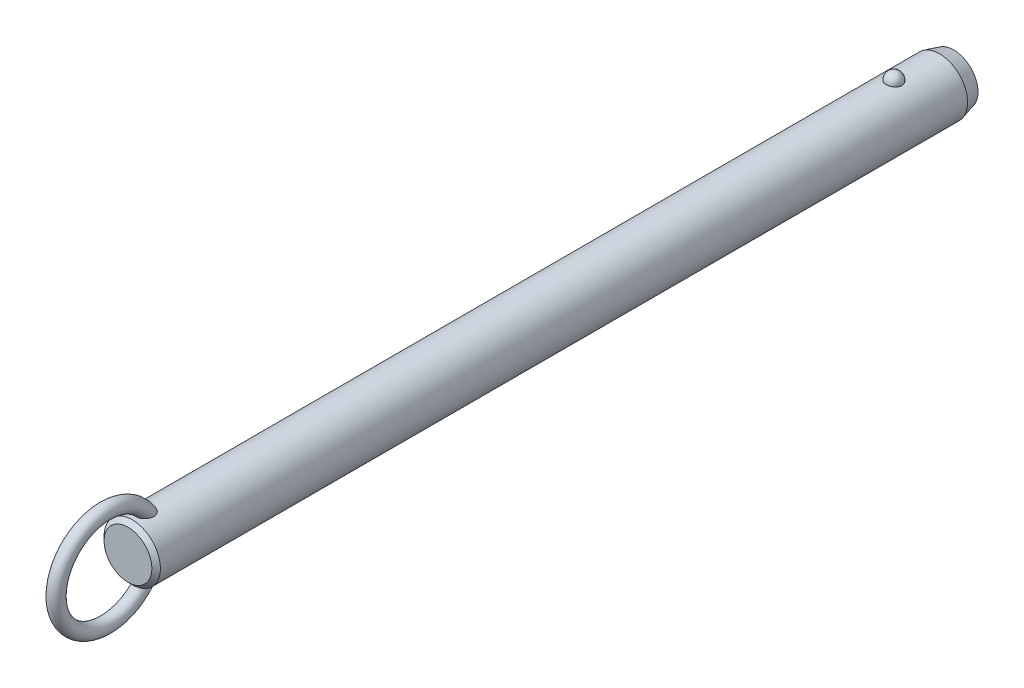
ISO-10303-21;
HEADER;
FILE_DESCRIPTION(('STEP AP214'),'2;1');
FILE_NAME('part.step','',(''),(''),'','','');
FILE_SCHEMA(('AUTOMOTIVE_DESIGN { 1 0 10303 214 1 1 1 1 }'));
ENDSEC;
DATA;
#1=APPLICATION_CONTEXT('core data for automotive mechanical design processes');
#2=APPLICATION_PROTOCOL_DEFINITION('international standard','automotive_design',2000,#1);
#3=PRODUCT_CONTEXT('',#1,'mechanical');
#4=PRODUCT('Part','Part','',(#3));
#5=PRODUCT_RELATED_PRODUCT_CATEGORY('part','',(#4));
#6=PRODUCT_DEFINITION_FORMATION('','',#4);
#7=PRODUCT_DEFINITION_CONTEXT('part definition',#1,'design');
#8=PRODUCT_DEFINITION('design','',#6,#7);
#9=PRODUCT_DEFINITION_SHAPE('','',#8);
#10=(LENGTH_UNIT() NAMED_UNIT(*) SI_UNIT(.MILLI.,.METRE.));
#11=(NAMED_UNIT(*) PLANE_ANGLE_UNIT() SI_UNIT($,.RADIAN.));
#12=(NAMED_UNIT(*) SI_UNIT($,.STERADIAN.) SOLID_ANGLE_UNIT());
#13=UNCERTAINTY_MEASURE_WITH_UNIT(LENGTH_MEASURE(1.E-05),#10,'distance_accuracy_value','');
#14=(GEOMETRIC_REPRESENTATION_CONTEXT(3) GLOBAL_UNCERTAINTY_ASSIGNED_CONTEXT((#13)) GLOBAL_UNIT_ASSIGNED_CONTEXT((#10,
#11,#12)) REPRESENTATION_CONTEXT('',''));
#15=CARTESIAN_POINT('',(0.,0.,0.));
#16=DIRECTION('',(0.,0.,1.));
#17=DIRECTION('',(1.,0.,0.));
#18=AXIS2_PLACEMENT_3D('',#15,#16,#17);
#19=CARTESIAN_POINT('',(0.,0.,203.2));
#20=DIRECTION('',(0.,0.,-1.));
#21=DIRECTION('',(-1.,0.,0.));
#22=AXIS2_PLACEMENT_3D('',#19,#20,#21);
#23=CYLINDRICAL_SURFACE('',#22,7.9);
#24=CARTESIAN_POINT('',(2.1785689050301,7.59367088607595,-2.20000000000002));
#25=CARTESIAN_POINT('',(2.17856679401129,7.59367269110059,-2.07701843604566));
#26=CARTESIAN_POINT('',(2.16853481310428,7.59657145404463,-1.95401006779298));
#27=CARTESIAN_POINT('',(2.12864689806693,7.607843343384,-1.71147811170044));
#28=CARTESIAN_POINT('',(2.09878338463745,7.61621856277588,-1.5919558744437));
#29=CARTESIAN_POINT('',(2.0199931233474,7.63749180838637,-1.35985638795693));
#30=CARTESIAN_POINT('',(1.97107475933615,7.6503878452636,-1.24727610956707));
#31=CARTESIAN_POINT('',(1.85539377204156,7.67926115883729,-1.03213234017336));
#32=CARTESIAN_POINT('',(1.78863158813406,7.69523835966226,-0.929568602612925));
#33=CARTESIAN_POINT('',(1.63856494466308,7.7285848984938,-0.73678633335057));
#34=CARTESIAN_POINT('',(1.55518140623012,7.7459606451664,-0.646630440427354));
#35=CARTESIAN_POINT('',(1.37422937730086,7.78009978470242,-0.481747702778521));
#36=CARTESIAN_POINT('',(1.27666086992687,7.79686317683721,-0.407020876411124));
#37=CARTESIAN_POINT('',(1.07024728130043,7.82786153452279,-0.275278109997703));
#38=CARTESIAN_POINT('',(0.961434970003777,7.84210353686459,-0.218212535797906));
#39=CARTESIAN_POINT('',(0.735351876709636,7.86652194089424,-0.123146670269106));
#40=CARTESIAN_POINT('',(0.618082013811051,7.87669878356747,-0.0851443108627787));
#41=CARTESIAN_POINT('',(0.380637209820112,7.89170521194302,-0.0298158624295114));
#42=CARTESIAN_POINT('',(0.260550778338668,7.89662650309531,-0.0121347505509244));
#43=CARTESIAN_POINT('',(0.0190117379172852,7.90090003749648,0.00324379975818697));
#44=CARTESIAN_POINT('',(-0.102440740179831,7.90025280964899,0.000943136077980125));
#45=CARTESIAN_POINT('',(-0.341452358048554,7.89351056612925,-0.0233955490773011));
#46=CARTESIAN_POINT('',(-0.459042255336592,7.88749257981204,-0.0451545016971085));
#47=CARTESIAN_POINT('',(-0.688796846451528,7.87075812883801,-0.107408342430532));
#48=CARTESIAN_POINT('',(-0.800961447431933,7.86004158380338,-0.14790355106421));
#49=CARTESIAN_POINT('',(-1.01743634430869,7.83497131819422,-0.246799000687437));
#50=CARTESIAN_POINT('',(-1.12169791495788,7.82059709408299,-0.305300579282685));
#51=CARTESIAN_POINT('',(-1.31891765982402,7.78976470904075,-0.43854939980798));
#52=CARTESIAN_POINT('',(-1.41187469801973,7.77330633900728,-0.513298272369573));
#53=CARTESIAN_POINT('',(-1.58577142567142,7.73972434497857,-0.678622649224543));
#54=CARTESIAN_POINT('',(-1.66645140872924,7.72259402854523,-0.769470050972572));
#55=CARTESIAN_POINT('',(-1.81161503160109,7.68983776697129,-0.963538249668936));
#56=CARTESIAN_POINT('',(-1.87609753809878,7.6742119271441,-1.0667599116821));
#57=CARTESIAN_POINT('',(-1.98790138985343,7.6460202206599,-1.28401170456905));
#58=CARTESIAN_POINT('',(-2.03501994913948,7.63349104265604,-1.39815107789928));
#59=CARTESIAN_POINT('',(-2.10986724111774,7.6131449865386,-1.6330178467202));
#60=CARTESIAN_POINT('',(-2.1375965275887,7.60532797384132,-1.75374505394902));
#61=CARTESIAN_POINT('',(-2.17289256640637,7.5953195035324,-1.99782562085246));
#62=CARTESIAN_POINT('',(-2.18054294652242,7.59310471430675,-2.12116592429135));
#63=CARTESIAN_POINT('',(-2.17572919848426,7.59448538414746,-2.36741799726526));
#64=CARTESIAN_POINT('',(-2.1632656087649,7.59808068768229,-2.49032977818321));
#65=CARTESIAN_POINT('',(-2.11865035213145,7.61064035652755,-2.73161015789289));
#66=CARTESIAN_POINT('',(-2.08659579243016,7.61957823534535,-2.84999812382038));
#67=CARTESIAN_POINT('',(-2.00367799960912,7.64179982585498,-3.07955956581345));
#68=CARTESIAN_POINT('',(-1.9528140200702,7.65508371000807,-3.19073275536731));
#69=CARTESIAN_POINT('',(-1.83321113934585,7.68460381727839,-3.40337899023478));
#70=CARTESIAN_POINT('',(-1.76437735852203,7.70085556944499,-3.5047965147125));
#71=CARTESIAN_POINT('',(-1.61069526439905,7.73445734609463,-3.69446912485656));
#72=CARTESIAN_POINT('',(-1.52584634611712,7.75180741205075,-3.78272371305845));
#73=CARTESIAN_POINT('',(-1.34198059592,7.78574608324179,-3.94393987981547));
#74=CARTESIAN_POINT('',(-1.24291308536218,7.80233167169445,-4.01684434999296));
#75=CARTESIAN_POINT('',(-1.03352039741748,7.83281625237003,-4.14489386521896));
#76=CARTESIAN_POINT('',(-0.92319600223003,7.84671543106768,-4.20004014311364));
#77=CARTESIAN_POINT('',(-0.695822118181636,7.87011575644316,-4.29042017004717));
#78=CARTESIAN_POINT('',(-0.578872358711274,7.87966903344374,-4.32589112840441));
#79=CARTESIAN_POINT('',(-0.340410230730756,7.8935652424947,-4.37692226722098));
#80=CARTESIAN_POINT('',(-0.218898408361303,7.89790879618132,-4.39248482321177));
#81=CARTESIAN_POINT('',(0.0228107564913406,7.90087453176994,-4.40314405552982));
#82=CARTESIAN_POINT('',(0.142990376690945,7.89960185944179,-4.39861683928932));
#83=CARTESIAN_POINT('',(0.380829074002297,7.89171262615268,-4.37008293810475));
#84=CARTESIAN_POINT('',(0.498488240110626,7.8850962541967,-4.34607694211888));
#85=CARTESIAN_POINT('',(0.727535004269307,7.86726442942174,-4.27939317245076));
#86=CARTESIAN_POINT('',(0.838944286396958,7.85606616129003,-4.23678512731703));
#87=CARTESIAN_POINT('',(1.05295421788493,7.83025654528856,-4.13408348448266));
#88=CARTESIAN_POINT('',(1.15555431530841,7.81564498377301,-4.07398879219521));
#89=CARTESIAN_POINT('',(1.35076763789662,7.7843022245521,-3.93687432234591));
#90=CARTESIAN_POINT('',(1.4432046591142,7.76754209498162,-3.85961036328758));
#91=CARTESIAN_POINT('',(1.6139111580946,7.73387857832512,-3.69076949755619));
#92=CARTESIAN_POINT('',(1.6921781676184,7.71697516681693,-3.59919010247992));
#93=CARTESIAN_POINT('',(1.83380875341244,7.6845643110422,-3.40247278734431));
#94=CARTESIAN_POINT('',(1.89689280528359,7.66908588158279,-3.29712873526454));
#95=CARTESIAN_POINT('',(2.0047823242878,7.64159441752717,-3.07707931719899));
#96=CARTESIAN_POINT('',(2.0495945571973,7.62958010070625,-2.96237743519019));
#97=CARTESIAN_POINT('',(2.11580183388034,7.61146617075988,-2.74040519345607));
#98=CARTESIAN_POINT('',(2.13929812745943,7.60484503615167,-2.63379846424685));
#99=CARTESIAN_POINT('',(2.17068242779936,7.59594664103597,-2.4181348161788));
#100=CARTESIAN_POINT('',(2.17857077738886,7.59366928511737,-2.30907795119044));
#101=CARTESIAN_POINT('',(2.1785689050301,7.59367088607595,-2.20000000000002));
#102=B_SPLINE_CURVE_WITH_KNOTS('',3,(#24,#25,#26,#27,#28,#29,#30,#31,#32,#33,#34,#35,#36,#37,
#38,#39,#40,#41,#42,#43,#44,#45,#46,#47,#48,#49,#50,#51,#52,#53,#54,#55,#56,#57,#58,#59,#60,#61,
#62,#63,#64,#65,#66,#67,#68,#69,#70,#71,#72,#73,#74,#75,#76,#77,#78,#79,#80,#81,#82,#83,#84,#85,
#86,#87,#88,#89,#90,#91,#92,#93,#94,#95,#96,#97,#98,#99,#100,#101),.UNSPECIFIED.,.T.,.F.,(4,2,2,
2,2,2,2,2,2,2,2,2,2,2,2,2,2,2,2,2,2,2,2,2,2,2,2,2,2,2,2,2,2,2,2,2,2,2,4),(0.,0.368552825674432,
0.737246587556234,1.10577831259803,1.4743009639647,1.8446206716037,2.21494081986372,
2.5842105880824,2.95344028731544,3.31611630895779,3.67875788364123,4.03628044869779,
4.39380913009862,4.75338791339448,5.11300280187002,5.47939989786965,5.8458226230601,
6.21639834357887,6.58696347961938,6.95598276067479,7.32499216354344,7.69218715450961,
8.0593967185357,8.42858578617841,8.79778880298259,9.16834203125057,9.5388695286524,
9.90482699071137,10.2707407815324,10.6298333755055,10.9889132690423,11.3466585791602,
11.7044262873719,12.0676511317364,12.4309391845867,12.8004764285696,13.1698767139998,
13.4967701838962,13.8236564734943),.UNSPECIFIED.);
#103=CARTESIAN_POINT('',(2.1785689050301,7.59367088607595,-2.20000000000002));
#104=VERTEX_POINT('',#103);
#105=EDGE_CURVE('E41',#104,#104,#102,.T.);
#106=ORIENTED_EDGE('',*,*,#105,.T.);
#107=EDGE_LOOP('',(#106));
#108=FACE_BOUND('',#107,.T.);
#109=CARTESIAN_POINT('',(0.,0.,211.52));
#110=DIRECTION('',(0.,0.,1.));
#111=DIRECTION('',(1.,0.,0.));
#112=AXIS2_PLACEMENT_3D('',#109,#110,#111);
#113=CIRCLE('',#112,7.9);
#114=CARTESIAN_POINT('',(7.9,0.,211.52));
#115=VERTEX_POINT('',#114);
#116=EDGE_CURVE('E10',#115,#115,#113,.F.);
#117=ORIENTED_EDGE('',*,*,#116,.T.);
#118=EDGE_LOOP('',(#117));
#119=FACE_BOUND('',#118,.T.);
#120=CARTESIAN_POINT('',(-0.630969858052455,-7.87476203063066,205.412432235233));
#121=CARTESIAN_POINT('',(-0.734180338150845,-7.86648998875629,205.447285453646));
#122=CARTESIAN_POINT('',(-0.834476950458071,-7.85639291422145,205.490816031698));
#123=CARTESIAN_POINT('',(-1.0262035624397,-7.83366343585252,205.594094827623));
#124=CARTESIAN_POINT('',(-1.11761413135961,-7.82102565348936,205.653877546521));
#125=CARTESIAN_POINT('',(-1.28877277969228,-7.79464922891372,205.787839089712));
#126=CARTESIAN_POINT('',(-1.36854014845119,-7.7809124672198,205.861993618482));
#127=CARTESIAN_POINT('',(-1.51461521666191,-7.75380398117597,206.022494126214));
#128=CARTESIAN_POINT('',(-1.58092966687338,-7.74043207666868,206.108833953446));
#129=CARTESIAN_POINT('',(-1.70019064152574,-7.7151252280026,206.292978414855));
#130=CARTESIAN_POINT('',(-1.75284037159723,-7.70322473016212,206.390979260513));
#131=CARTESIAN_POINT('',(-1.84263464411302,-7.68224112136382,206.594102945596));
#132=CARTESIAN_POINT('',(-1.87977299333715,-7.6731591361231,206.699228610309));
#133=CARTESIAN_POINT('',(-1.94152728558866,-7.65777930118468,206.923284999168));
#134=CARTESIAN_POINT('',(-1.96475471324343,-7.65179654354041,207.042616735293));
#135=CARTESIAN_POINT('',(-1.99449499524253,-7.64409642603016,207.28342986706));
#136=CARTESIAN_POINT('',(-2.0010005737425,-7.64238092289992,207.404912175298));
#137=CARTESIAN_POINT('',(-1.99856014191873,-7.64302120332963,207.668340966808));
#138=CARTESIAN_POINT('',(-1.98680021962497,-7.64611845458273,207.81025654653));
#139=CARTESIAN_POINT('',(-1.94457772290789,-7.65696186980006,208.091118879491));
#140=CARTESIAN_POINT('',(-1.91409393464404,-7.66471330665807,208.230062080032));
#141=CARTESIAN_POINT('',(-1.82768670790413,-7.68582947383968,208.531939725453));
#142=CARTESIAN_POINT('',(-1.76772963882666,-7.70003779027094,208.693686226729));
#143=CARTESIAN_POINT('',(-1.65998501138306,-7.72371550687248,208.927695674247));
#144=CARTESIAN_POINT('',(-1.62107967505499,-7.73200670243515,209.004297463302));
#145=CARTESIAN_POINT('',(-1.53727726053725,-7.7491037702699,209.154079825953));
#146=CARTESIAN_POINT('',(-1.49238215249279,-7.75790947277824,209.227261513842));
#147=CARTESIAN_POINT('',(-1.37397050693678,-7.77993338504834,209.40288382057));
#148=CARTESIAN_POINT('',(-1.29690364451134,-7.79328473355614,209.502955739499));
#149=CARTESIAN_POINT('',(-1.12885487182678,-7.81939266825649,209.690714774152));
#150=CARTESIAN_POINT('',(-1.03789926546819,-7.83215032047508,209.778424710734));
#151=CARTESIAN_POINT('',(-0.869532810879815,-7.85231710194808,209.913414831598));
#152=CARTESIAN_POINT('',(-0.795716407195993,-7.86021093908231,209.965076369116));
#153=CARTESIAN_POINT('',(-0.640813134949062,-7.87434920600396,210.056381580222));
#154=CARTESIAN_POINT('',(-0.559737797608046,-7.88059619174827,210.09604389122));
#155=CARTESIAN_POINT('',(-0.40645605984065,-7.88984116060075,210.154300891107));
#156=CARTESIAN_POINT('',(-0.335227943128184,-7.89321892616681,210.175384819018));
#157=CARTESIAN_POINT('',(-0.190193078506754,-7.89804235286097,210.20541418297));
#158=CARTESIAN_POINT('',(-0.116388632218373,-7.89948969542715,210.214370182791));
#159=CARTESIAN_POINT('',(0.0318414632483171,-7.90028409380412,210.219291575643));
#160=CARTESIAN_POINT('',(0.106268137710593,-7.89962640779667,210.215227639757));
#161=CARTESIAN_POINT('',(0.253290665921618,-7.8962818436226,210.194461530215));
#162=CARTESIAN_POINT('',(0.325885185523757,-7.8935935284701,210.177750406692));
#163=CARTESIAN_POINT('',(0.481441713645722,-7.88577340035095,210.128738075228));
#164=CARTESIAN_POINT('',(0.563611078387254,-7.88026321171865,210.094005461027));
#165=CARTESIAN_POINT('',(0.721129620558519,-7.86741729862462,210.011796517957));
#166=CARTESIAN_POINT('',(0.796466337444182,-7.86007832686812,209.964297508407));
#167=CARTESIAN_POINT('',(0.971456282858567,-7.84073285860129,209.836513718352));
#168=CARTESIAN_POINT('',(1.06719686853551,-7.82809461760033,209.751004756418));
#169=CARTESIAN_POINT('',(1.24418921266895,-7.80192439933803,209.566232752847));
#170=CARTESIAN_POINT('',(1.32540832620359,-7.78839049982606,209.466939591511));
#171=CARTESIAN_POINT('',(1.45199971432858,-7.76559693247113,209.289576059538));
#172=CARTESIAN_POINT('',(1.50085649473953,-7.75626094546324,209.213954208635));
#173=CARTESIAN_POINT('',(1.59197749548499,-7.73807279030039,209.058742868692));
#174=CARTESIAN_POINT('',(1.63423919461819,-7.72922080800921,208.979151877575));
#175=CARTESIAN_POINT('',(1.71222612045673,-7.71231959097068,208.816664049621));
#176=CARTESIAN_POINT('',(1.7479451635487,-7.70427111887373,208.733764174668));
#177=CARTESIAN_POINT('',(1.81270113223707,-7.68929240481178,208.565296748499));
#178=CARTESIAN_POINT('',(1.84173789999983,-7.68236218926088,208.479729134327));
#179=CARTESIAN_POINT('',(1.89322698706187,-7.66983757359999,208.30528702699));
#180=CARTESIAN_POINT('',(1.91558744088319,-7.66426199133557,208.216383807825));
#181=CARTESIAN_POINT('',(1.95281367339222,-7.65485915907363,208.036969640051));
#182=CARTESIAN_POINT('',(1.96767946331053,-7.65103190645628,207.946458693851));
#183=CARTESIAN_POINT('',(2.00021456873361,-7.64262981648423,207.673732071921));
#184=CARTESIAN_POINT('',(2.00600691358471,-7.6410871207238,207.489709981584));
#185=CARTESIAN_POINT('',(1.98445334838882,-7.64669564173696,207.176501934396));
#186=CARTESIAN_POINT('',(1.96607186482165,-7.65149688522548,207.046618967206));
#187=CARTESIAN_POINT('',(1.90884967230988,-7.6659762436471,206.791632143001));
#188=CARTESIAN_POINT('',(1.87002101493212,-7.67565148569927,206.666525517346));
#189=CARTESIAN_POINT('',(1.77063986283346,-7.69918471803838,206.42454013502));
#190=CARTESIAN_POINT('',(1.70993724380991,-7.71307150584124,206.307725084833));
#191=CARTESIAN_POINT('',(1.56733070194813,-7.74330306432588,206.088144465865));
#192=CARTESIAN_POINT('',(1.48543692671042,-7.75964665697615,205.985372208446));
#193=CARTESIAN_POINT('',(1.31346177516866,-7.79047523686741,205.809380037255));
#194=CARTESIAN_POINT('',(1.22547278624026,-7.80495298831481,205.734106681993));
#195=CARTESIAN_POINT('',(1.0372435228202,-7.83218597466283,205.600486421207));
#196=CARTESIAN_POINT('',(0.937008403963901,-7.84494192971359,205.542132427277));
#197=CARTESIAN_POINT('',(0.733599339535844,-7.86649045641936,205.447027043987));
#198=CARTESIAN_POINT('',(0.630941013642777,-7.87547134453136,205.409210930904));
#199=CARTESIAN_POINT('',(0.420465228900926,-7.88950708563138,205.351116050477));
#200=CARTESIAN_POINT('',(0.31264590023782,-7.89456050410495,205.33084369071));
#201=CARTESIAN_POINT('',(0.0960869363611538,-7.9001518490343,205.308455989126));
#202=CARTESIAN_POINT('',(-0.0126341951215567,-7.90073226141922,205.306169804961));
#203=CARTESIAN_POINT('',(-0.228766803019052,-7.89742350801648,205.319367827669));
#204=CARTESIAN_POINT('',(-0.336180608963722,-7.89354403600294,205.334813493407));
#205=CARTESIAN_POINT('',(-0.473410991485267,-7.88586871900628,205.366217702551));
#206=CARTESIAN_POINT('',(-0.505257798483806,-7.88388984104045,205.374354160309));
#207=CARTESIAN_POINT('',(-0.568481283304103,-7.87958326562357,205.392208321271));
#208=CARTESIAN_POINT('',(-0.599857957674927,-7.87725556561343,205.401926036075));
#209=CARTESIAN_POINT('',(-0.630969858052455,-7.87476203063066,205.412432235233));
#210=B_SPLINE_CURVE_WITH_KNOTS('',3,(#120,#121,#122,#123,#124,#125,#126,#127,#128,#129,#130,
#131,#132,#133,#134,#135,#136,#137,#138,#139,#140,#141,#142,#143,#144,#145,#146,#147,#148,#149,
#150,#151,#152,#153,#154,#155,#156,#157,#158,#159,#160,#161,#162,#163,#164,#165,#166,#167,#168,
#169,#170,#171,#172,#173,#174,#175,#176,#177,#178,#179,#180,#181,#182,#183,#184,#185,#186,#187,
#188,#189,#190,#191,#192,#193,#194,#195,#196,#197,#198,#199,#200,#201,#202,#203,#204,#205,#206,
#207,#208,#209),.UNSPECIFIED.,.T.,.F.,(4,2,2,2,2,2,2,2,2,2,2,2,2,2,2,2,2,2,2,2,2,2,2,2,2,2,2,2,
2,2,2,2,2,2,2,2,2,2,2,2,2,2,2,2,4),(0.,0.327622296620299,0.655945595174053,0.983718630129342,
1.3113267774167,1.64554655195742,1.97989964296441,2.34365728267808,2.70757317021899,
3.13333684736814,3.5595838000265,4.07655306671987,4.33527897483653,4.59391999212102,
4.97382437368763,5.353017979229,5.62348245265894,5.89352465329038,6.11565959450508,
6.33760092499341,6.56004255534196,6.78264174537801,7.04930844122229,7.31645206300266,
7.7013087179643,8.08701995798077,8.35824509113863,8.62957365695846,8.90115735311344,
9.17274746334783,9.44791855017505,9.72308922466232,10.2715298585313,10.6638393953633,
11.0559179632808,11.4507403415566,11.8453740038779,12.1936425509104,12.5417649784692,
12.8695063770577,13.1973674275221,13.5221104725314,13.8461490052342,13.9449071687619,
14.0436660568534),.UNSPECIFIED.);
#211=CARTESIAN_POINT('',(-0.630969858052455,-7.87476203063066,205.412432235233));
#212=VERTEX_POINT('',#211);
#213=EDGE_CURVE('E60',#212,#212,#210,.T.);
#214=ORIENTED_EDGE('',*,*,#213,.T.);
#215=EDGE_LOOP('',(#214));
#216=FACE_BOUND('',#215,.T.);
#217=CARTESIAN_POINT('',(-0.630969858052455,7.87476203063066,205.412432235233));
#218=CARTESIAN_POINT('',(-0.528918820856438,7.8829363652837,205.377979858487));
#219=CARTESIAN_POINT('',(-0.423745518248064,7.88934810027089,205.351915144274));
#220=CARTESIAN_POINT('',(-0.210236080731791,7.8979273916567,205.317282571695));
#221=CARTESIAN_POINT('',(-0.101893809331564,7.90008607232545,205.308751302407));
#222=CARTESIAN_POINT('',(0.114660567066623,7.89990877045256,205.309457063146));
#223=CARTESIAN_POINT('',(0.222872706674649,7.89757640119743,205.31867980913));
#224=CARTESIAN_POINT('',(0.436107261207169,7.88867538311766,205.354652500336));
#225=CARTESIAN_POINT('',(0.541131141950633,7.8821087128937,205.38139425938));
#226=CARTESIAN_POINT('',(0.745085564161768,7.86545130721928,205.451756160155));
#227=CARTESIAN_POINT('',(0.844015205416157,7.85536005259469,205.495378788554));
#228=CARTESIAN_POINT('',(1.03299167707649,7.83275153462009,205.598379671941));
#229=CARTESIAN_POINT('',(1.12303841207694,7.82023424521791,205.657758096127));
#230=CARTESIAN_POINT('',(1.29214734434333,7.79408219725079,205.790864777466));
#231=CARTESIAN_POINT('',(1.3711690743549,7.78044359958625,205.864643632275));
#232=CARTESIAN_POINT('',(1.51597677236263,7.75353170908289,206.024235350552));
#233=CARTESIAN_POINT('',(1.58176261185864,7.74025841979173,206.110048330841));
#234=CARTESIAN_POINT('',(1.70057386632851,7.71504069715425,206.293644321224));
#235=CARTESIAN_POINT('',(1.75320073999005,7.7031425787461,206.391690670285));
#236=CARTESIAN_POINT('',(1.84293767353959,7.68216822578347,206.594893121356));
#237=CARTESIAN_POINT('',(1.88004278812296,7.67309289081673,206.700051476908));
#238=CARTESIAN_POINT('',(1.94172327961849,7.6577294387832,206.924167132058));
#239=CARTESIAN_POINT('',(1.96491037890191,7.65175648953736,207.043524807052));
#240=CARTESIAN_POINT('',(1.9945689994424,7.64407702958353,207.284384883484));
#241=CARTESIAN_POINT('',(2.00103304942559,7.64237242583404,207.40588821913));
#242=CARTESIAN_POINT('',(1.99850166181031,7.64303650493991,207.669368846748));
#243=CARTESIAN_POINT('',(1.98669038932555,7.64614714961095,207.811314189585));
#244=CARTESIAN_POINT('',(1.94436120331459,7.65701701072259,208.092228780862));
#245=CARTESIAN_POINT('',(1.91382203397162,7.66478150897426,208.231194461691));
#246=CARTESIAN_POINT('',(1.82728754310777,7.68592483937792,208.533111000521));
#247=CARTESIAN_POINT('',(1.7672577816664,7.7001468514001,208.694872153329));
#248=CARTESIAN_POINT('',(1.65939700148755,7.72384204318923,208.928891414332));
#249=CARTESIAN_POINT('',(1.62045187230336,7.73213852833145,209.005494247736));
#250=CARTESIAN_POINT('',(1.53656684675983,7.74924489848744,209.155273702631));
#251=CARTESIAN_POINT('',(1.49162892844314,7.75805461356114,209.228451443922));
#252=CARTESIAN_POINT('',(1.37317698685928,7.78007342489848,209.403952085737));
#253=CARTESIAN_POINT('',(1.29612360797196,7.79341423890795,209.503911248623));
#254=CARTESIAN_POINT('',(1.12812043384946,7.81949839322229,209.69145083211));
#255=CARTESIAN_POINT('',(1.0371968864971,7.83224280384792,209.779054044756));
#256=CARTESIAN_POINT('',(0.868871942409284,7.85239026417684,209.91389715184));
#257=CARTESIAN_POINT('',(0.795056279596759,7.86027769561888,209.965511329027));
#258=CARTESIAN_POINT('',(0.640160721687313,7.87440222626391,210.056720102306));
#259=CARTESIAN_POINT('',(0.559092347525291,7.88064188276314,210.096333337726));
#260=CARTESIAN_POINT('',(0.405820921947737,7.8898738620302,210.154505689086));
#261=CARTESIAN_POINT('',(0.334594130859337,7.89324577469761,210.175552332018));
#262=CARTESIAN_POINT('',(0.189568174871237,7.89805733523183,210.205507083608));
#263=CARTESIAN_POINT('',(0.115771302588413,7.89949866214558,210.214425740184));
#264=CARTESIAN_POINT('',(-0.0324359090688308,7.90028156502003,210.21927589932));
#265=CARTESIAN_POINT('',(-0.106847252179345,7.89961843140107,210.215178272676));
#266=CARTESIAN_POINT('',(-0.253834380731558,7.8962642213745,210.194351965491));
#267=CARTESIAN_POINT('',(-0.326408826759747,7.89357170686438,210.177614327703));
#268=CARTESIAN_POINT('',(-0.481962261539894,7.88574179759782,210.128539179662));
#269=CARTESIAN_POINT('',(-0.564145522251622,7.88022507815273,210.093763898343));
#270=CARTESIAN_POINT('',(-0.721685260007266,7.8673664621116,210.011468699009));
#271=CARTESIAN_POINT('',(-0.797029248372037,7.8600213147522,209.963926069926));
#272=CARTESIAN_POINT('',(-0.972044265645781,7.84066026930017,209.836026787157));
#273=CARTESIAN_POINT('',(-1.06779803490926,7.82801274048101,209.750443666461));
#274=CARTESIAN_POINT('',(-1.24480531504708,7.80182621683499,209.565522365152));
#275=CARTESIAN_POINT('',(-1.32602618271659,7.78828530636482,209.466154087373));
#276=CARTESIAN_POINT('',(-1.45259834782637,7.76548487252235,209.288680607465));
#277=CARTESIAN_POINT('',(-1.50143856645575,7.75614818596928,209.213025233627));
#278=CARTESIAN_POINT('',(-1.59252410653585,7.73796020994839,209.057748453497));
#279=CARTESIAN_POINT('',(-1.63476690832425,7.72910910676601,208.978125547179));
#280=CARTESIAN_POINT('',(-1.71271318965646,7.71221133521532,208.815575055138));
#281=CARTESIAN_POINT('',(-1.7484104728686,7.70416543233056,208.732644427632));
#282=CARTESIAN_POINT('',(-1.81311929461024,7.6891937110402,208.564116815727));
#283=CARTESIAN_POINT('',(-1.84213067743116,7.68226791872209,208.478519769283));
#284=CARTESIAN_POINT('',(-1.89356259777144,7.66975461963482,208.304025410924));
#285=CARTESIAN_POINT('',(-1.91589165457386,7.66418586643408,208.215099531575));
#286=CARTESIAN_POINT('',(-1.95305070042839,7.65479859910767,208.035642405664));
#287=CARTESIAN_POINT('',(-1.96788069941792,7.65098008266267,207.945111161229));
#288=CARTESIAN_POINT('',(-2.00030078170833,7.64260704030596,207.672327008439));
#289=CARTESIAN_POINT('',(-2.00600576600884,7.64108760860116,207.488271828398));
#290=CARTESIAN_POINT('',(-1.98428483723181,7.64673945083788,207.175080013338));
#291=CARTESIAN_POINT('',(-1.96583698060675,7.6515575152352,207.045240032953));
#292=CARTESIAN_POINT('',(-1.90848948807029,7.66606613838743,206.790361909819));
#293=CARTESIAN_POINT('',(-1.86960376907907,7.67575338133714,206.665320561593));
#294=CARTESIAN_POINT('',(-1.77013421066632,7.69930132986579,206.423500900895));
#295=CARTESIAN_POINT('',(-1.70940488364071,7.71318991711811,206.306784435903));
#296=CARTESIAN_POINT('',(-1.56672953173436,7.74342495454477,206.087340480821));
#297=CARTESIAN_POINT('',(-1.48478316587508,7.75977144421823,205.98461321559));
#298=CARTESIAN_POINT('',(-1.31266325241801,7.7906116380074,205.808643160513));
#299=CARTESIAN_POINT('',(-1.2245638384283,7.80509908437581,205.733358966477));
#300=CARTESIAN_POINT('',(-1.03622400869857,7.83231881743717,205.599865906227));
#301=CARTESIAN_POINT('',(-0.936015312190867,7.84505551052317,205.541613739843));
#302=CARTESIAN_POINT('',(-0.798824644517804,7.85957802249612,205.477540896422));
#303=CARTESIAN_POINT('',(-0.765787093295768,7.86286821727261,205.463224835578));
#304=CARTESIAN_POINT('',(-0.698939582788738,7.86909211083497,205.436436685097));
#305=CARTESIAN_POINT('',(-0.665129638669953,7.87202581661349,205.423964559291));
#306=CARTESIAN_POINT('',(-0.630969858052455,7.87476203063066,205.412432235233));
#307=B_SPLINE_CURVE_WITH_KNOTS('',3,(#217,#218,#219,#220,#221,#222,#223,#224,#225,#226,#227,
#228,#229,#230,#231,#232,#233,#234,#235,#236,#237,#238,#239,#240,#241,#242,#243,#244,#245,#246,
#247,#248,#249,#250,#251,#252,#253,#254,#255,#256,#257,#258,#259,#260,#261,#262,#263,#264,#265,
#266,#267,#268,#269,#270,#271,#272,#273,#274,#275,#276,#277,#278,#279,#280,#281,#282,#283,#284,
#285,#286,#287,#288,#289,#290,#291,#292,#293,#294,#295,#296,#297,#298,#299,#300,#301,#302,#303,
#304,#305,#306),.UNSPECIFIED.,.T.,.F.,(4,2,2,2,2,2,2,2,2,2,2,2,2,2,2,2,2,2,2,2,2,2,2,2,2,2,2,2,
2,2,2,2,2,2,2,2,2,2,2,2,2,2,2,2,4),(0.,0.323920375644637,0.648516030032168,0.972850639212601,
1.29703380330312,1.62126473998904,1.94549915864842,2.27089401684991,2.59629203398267,
2.93059633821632,3.26500707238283,3.62881644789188,3.99278833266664,4.41865421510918,
4.84500434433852,5.36209210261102,5.620875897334,5.87957448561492,6.25918598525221,
6.6380878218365,6.90846748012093,7.17842501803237,7.40052350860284,7.62242871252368,
7.84483086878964,8.0673907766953,8.33414615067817,8.60137921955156,8.98641454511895,
9.37230415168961,9.64358673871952,9.91497268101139,10.1866142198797,10.4582620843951,
10.7334745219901,11.008686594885,11.5572126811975,11.9494246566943,12.3413699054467,
12.7359755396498,13.1305875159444,13.4791770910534,13.82687259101,13.9353013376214,
14.0437279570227),.UNSPECIFIED.);
#308=CARTESIAN_POINT('',(-0.630969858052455,7.87476203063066,205.412432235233));
#309=VERTEX_POINT('',#308);
#310=EDGE_CURVE('E67',#309,#309,#307,.T.);
#311=ORIENTED_EDGE('',*,*,#310,.T.);
#312=EDGE_LOOP('',(#311));
#313=FACE_BOUND('',#312,.T.);
#314=CARTESIAN_POINT('',(0.,0.,-15.));
#315=DIRECTION('',(0.,0.,-1.));
#316=DIRECTION('',(-1.,0.,0.));
#317=AXIS2_PLACEMENT_3D('',#314,#315,#316);
#318=CIRCLE('',#317,7.9);
#319=CARTESIAN_POINT('',(-7.9,0.,-15.));
#320=VERTEX_POINT('',#319);
#321=EDGE_CURVE('E57',#320,#320,#318,.F.);
#322=ORIENTED_EDGE('',*,*,#321,.T.);
#323=EDGE_LOOP('',(#322));
#324=FACE_BOUND('',#323,.T.);
#325=ADVANCED_FACE('F37',(#108,#119,#216,#313,#324),#23,.T.);
#326=CARTESIAN_POINT('',(0.,0.,-19.));
#327=DIRECTION('',(0.,0.,-1.));
#328=DIRECTION('',(-1.,0.,0.));
#329=AXIS2_PLACEMENT_3D('',#326,#327,#328);
#330=PLANE('',#329);
#331=CARTESIAN_POINT('',(0.,0.,-19.));
#332=DIRECTION('',(0.,0.,-1.));
#333=DIRECTION('',(-1.,0.,0.));
#334=AXIS2_PLACEMENT_3D('',#331,#332,#333);
#335=CIRCLE('',#334,6.82820323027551);
#336=CARTESIAN_POINT('',(-6.82820323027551,0.,-19.));
#337=VERTEX_POINT('',#336);
#338=EDGE_CURVE('E66',#337,#337,#335,.T.);
#339=ORIENTED_EDGE('',*,*,#338,.T.);
#340=EDGE_LOOP('',(#339));
#341=FACE_BOUND('',#340,.T.);
#342=ADVANCED_FACE('F85',(#341),#330,.T.);
#343=CARTESIAN_POINT('',(0.,0.,-19.));
#344=DIRECTION('',(0.,0.,1.));
#345=DIRECTION('',(1.,0.,0.));
#346=AXIS2_PLACEMENT_3D('',#343,#344,#345);
#347=CONICAL_SURFACE('',#346,6.82820323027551,0.261799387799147);
#348=ORIENTED_EDGE('',*,*,#321,.F.);
#349=EDGE_LOOP('',(#348));
#350=FACE_BOUND('',#349,.T.);
#351=ORIENTED_EDGE('',*,*,#338,.F.);
#352=EDGE_LOOP('',(#351));
#353=FACE_BOUND('',#352,.T.);
#354=ADVANCED_FACE('F83',(#350,#353),#347,.T.);
#355=CARTESIAN_POINT('',(0.,0.,212.72));
#356=DIRECTION('',(0.,0.,1.));
#357=DIRECTION('',(1.,0.,0.));
#358=AXIS2_PLACEMENT_3D('',#355,#356,#357);
#359=PLANE('',#358);
#360=CARTESIAN_POINT('',(0.,0.,212.72));
#361=DIRECTION('',(0.,0.,1.));
#362=DIRECTION('',(1.,0.,0.));
#363=AXIS2_PLACEMENT_3D('',#360,#361,#362);
#364=CIRCLE('',#363,6.69999999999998);
#365=CARTESIAN_POINT('',(6.69999999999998,0.,212.72));
#366=VERTEX_POINT('',#365);
#367=EDGE_CURVE('E50',#366,#366,#364,.T.);
#368=ORIENTED_EDGE('',*,*,#367,.T.);
#369=EDGE_LOOP('',(#368));
#370=FACE_BOUND('',#369,.T.);
#371=ADVANCED_FACE('F77',(#370),#359,.T.);
#372=CARTESIAN_POINT('',(0.,0.,219.05));
#373=DIRECTION('',(1.,0.,0.));
#374=DIRECTION('',(0.,0.,-1.));
#375=AXIS2_PLACEMENT_3D('',#372,#373,#374);
#376=TOROIDAL_SURFACE('',#375,13.85,2.);
#377=ORIENTED_EDGE('',*,*,#310,.F.);
#378=EDGE_LOOP('',(#377));
#379=FACE_BOUND('',#378,.T.);
#380=ORIENTED_EDGE('',*,*,#213,.F.);
#381=EDGE_LOOP('',(#380));
#382=FACE_BOUND('',#381,.T.);
#383=ADVANCED_FACE('F73',(#379,#382),#376,.T.);
#384=CARTESIAN_POINT('',(0.,0.,212.72));
#385=DIRECTION('',(0.,0.,-1.));
#386=DIRECTION('',(-1.,0.,0.));
#387=AXIS2_PLACEMENT_3D('',#384,#385,#386);
#388=CONICAL_SURFACE('',#387,6.69999999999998,0.785398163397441);
#389=ORIENTED_EDGE('',*,*,#116,.F.);
#390=EDGE_LOOP('',(#389));
#391=FACE_BOUND('',#390,.T.);
#392=ORIENTED_EDGE('',*,*,#367,.F.);
#393=EDGE_LOOP('',(#392));
#394=FACE_BOUND('',#393,.T.);
#395=ADVANCED_FACE('F39',(#391,#394),#388,.T.);
#396=CARTESIAN_POINT('',(0.,7.9,-2.20000000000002));
#397=DIRECTION('',(0.,1.,0.));
#398=DIRECTION('',(0.,0.,1.));
#399=AXIS2_PLACEMENT_3D('',#396,#397,#398);
#400=SPHERICAL_SURFACE('',#399,2.2);
#401=ORIENTED_EDGE('',*,*,#105,.F.);
#402=EDGE_LOOP('',(#401));
#403=FACE_BOUND('',#402,.T.);
#404=ADVANCED_FACE('F79',(#403),#400,.T.);
#405=CLOSED_SHELL('',(#325,#342,#354,#371,#383,#395,#404));
#406=MANIFOLD_SOLID_BREP('B2',#405);
#407=ADVANCED_BREP_SHAPE_REPRESENTATION('',(#18,#406),#14);
#408=SHAPE_DEFINITION_REPRESENTATION(#9,#407);
ENDSEC;
END-ISO-10303-21;
